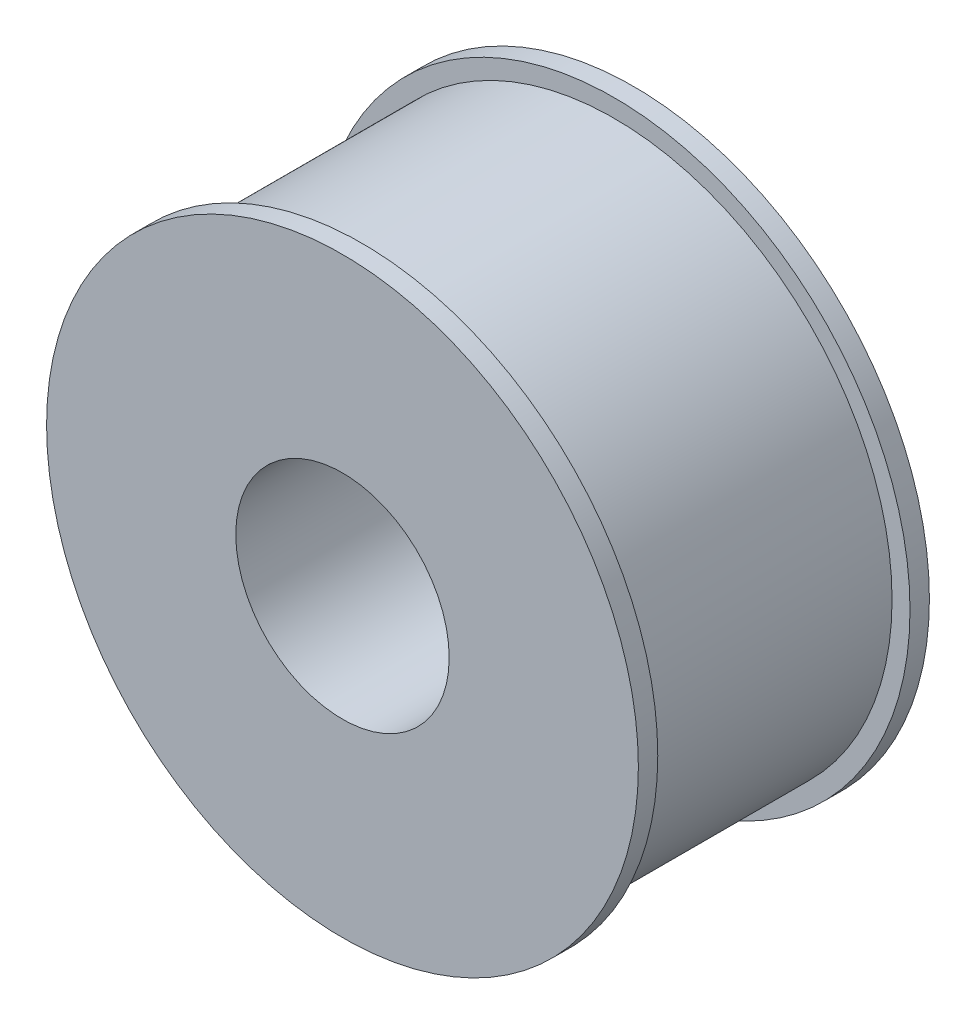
from build123d import *

# Parameters (mm, degrees)
SKETCH3_R          = 11
CUT_EXTRUDE1_DEPTH = 57.182737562
SKETCH8_R          = 2.1
CUT_EXTRUDE2_DEPTH = 57.182737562


with BuildPart() as part:
    # Sketch1 → Revolve1 (revolve)
    with BuildSketch(Plane(origin=(0, 0, 0), x_dir=(0, 0, -1), z_dir=(1, 0, 0)), mode=Mode.PRIVATE) as revolve1_sk:
        Polygon((0, 0), (0, 30.5), (2, 30.5), (2, 28.65), (28, 28.65), (28, 30.5), (30, 30.5), (30, 19), (36, 19), (36, 0), align=None)
    revolve(revolve1_sk.sketch.rotate(Axis((0, 0, 18.162162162), (0, 0, -1)), 90), axis=Axis((0, 0, 18.162162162), (0, 0, -1)))

    # Sketch3 → Cut-Extrude1 (cut, through all)
    with BuildSketch(Plane(origin=(0, 0, -36), x_dir=(-1, 0, 0), z_dir=(0, 0, -1))):
        Circle(SKETCH3_R)
    extrude(amount=-CUT_EXTRUDE1_DEPTH, mode=Mode.SUBTRACT)

    # Sketch8 → Cut-Extrude2 (cut, through all)
    with BuildSketch(Plane(origin=(0, 0, 0), x_dir=(0, 0, -1), z_dir=(1, 0, 0))):
        with Locations((33, 0)):
            Circle(SKETCH8_R)
    extrude(amount=-CUT_EXTRUDE2_DEPTH, mode=Mode.SUBTRACT)


solid = part.part
